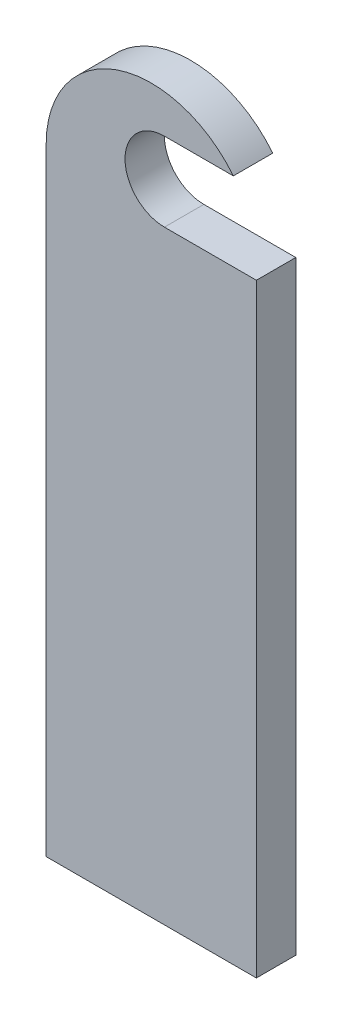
from build123d import *

# Parameters (mm, degrees)
BOSS_EXTRU_1_DEPTH = 3


with BuildPart() as part:
    # Esquisse1 → Boss.-Extru.1 (new body)
    with BuildSketch(Plane.XY):
        with BuildLine():
            Line((-8, 0), (8, 0))
            Line((8, 0), (8, 46))
            Line((8, 46), (1, 46))
            ThreePointArc((1, 46), (-2, 49), (1, 52))
            Line((1, 52), (6.244997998, 52))
            ThreePointArc((6.244997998, 52), (-2.649529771, 54.548509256), (-8, 47))
            Line((-8, 47), (-8, 0))
        make_face()
    extrude(amount=BOSS_EXTRU_1_DEPTH)


solid = part.part
